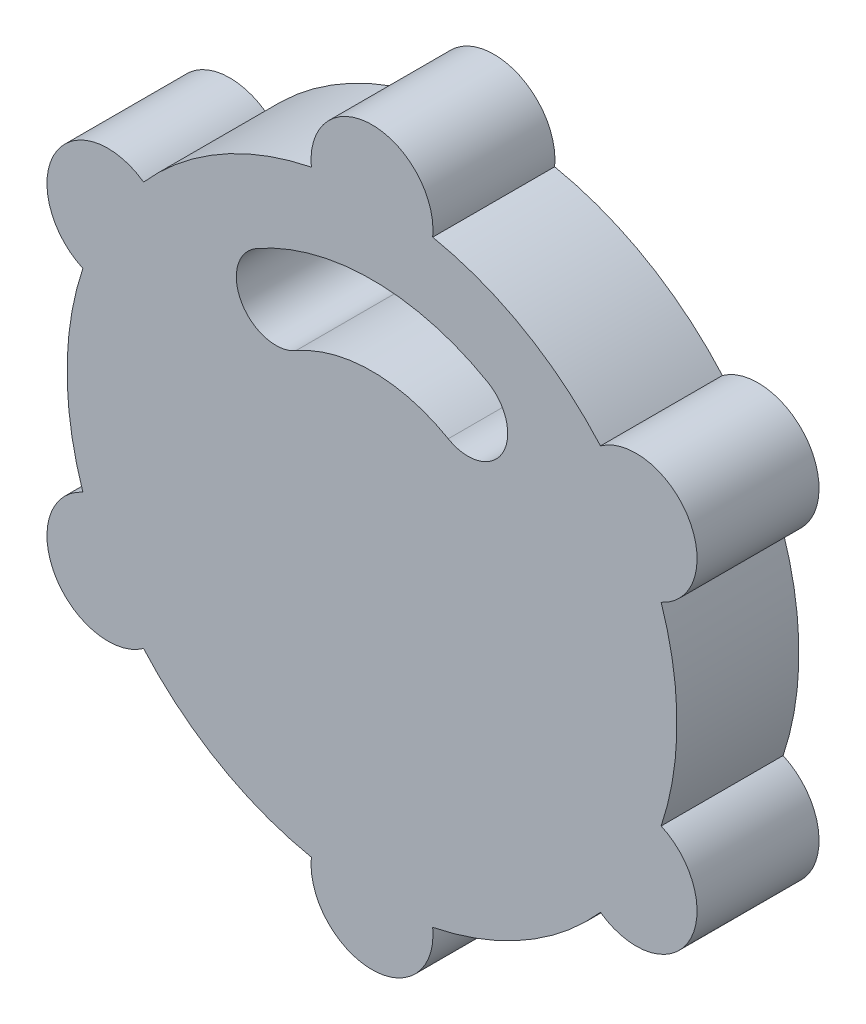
ISO-10303-21;
HEADER;
FILE_DESCRIPTION(('STEP AP214'),'2;1');
FILE_NAME('part.step','',(''),(''),'','','');
FILE_SCHEMA(('AUTOMOTIVE_DESIGN { 1 0 10303 214 1 1 1 1 }'));
ENDSEC;
DATA;
#1=APPLICATION_CONTEXT('core data for automotive mechanical design processes');
#2=APPLICATION_PROTOCOL_DEFINITION('international standard','automotive_design',2000,#1);
#3=PRODUCT_CONTEXT('',#1,'mechanical');
#4=PRODUCT('Part','Part','',(#3));
#5=PRODUCT_RELATED_PRODUCT_CATEGORY('part','',(#4));
#6=PRODUCT_DEFINITION_FORMATION('','',#4);
#7=PRODUCT_DEFINITION_CONTEXT('part definition',#1,'design');
#8=PRODUCT_DEFINITION('design','',#6,#7);
#9=PRODUCT_DEFINITION_SHAPE('','',#8);
#10=(LENGTH_UNIT() NAMED_UNIT(*) SI_UNIT(.MILLI.,.METRE.));
#11=(NAMED_UNIT(*) PLANE_ANGLE_UNIT() SI_UNIT($,.RADIAN.));
#12=(NAMED_UNIT(*) SI_UNIT($,.STERADIAN.) SOLID_ANGLE_UNIT());
#13=UNCERTAINTY_MEASURE_WITH_UNIT(LENGTH_MEASURE(1.E-05),#10,'distance_accuracy_value','');
#14=(GEOMETRIC_REPRESENTATION_CONTEXT(3) GLOBAL_UNCERTAINTY_ASSIGNED_CONTEXT((#13)) GLOBAL_UNIT_ASSIGNED_CONTEXT((#10,
#11,#12)) REPRESENTATION_CONTEXT('',''));
#15=CARTESIAN_POINT('',(0.,0.,0.));
#16=DIRECTION('',(0.,0.,1.));
#17=DIRECTION('',(1.,0.,0.));
#18=AXIS2_PLACEMENT_3D('',#15,#16,#17);
#19=CARTESIAN_POINT('',(43.301270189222,24.9999999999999,20.));
#20=DIRECTION('',(0.,0.,-1.));
#21=DIRECTION('',(-1.,0.,0.));
#22=AXIS2_PLACEMENT_3D('',#19,#20,#21);
#23=CYLINDRICAL_SURFACE('',#22,10.);
#24=CARTESIAN_POINT('',(43.301270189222,24.9999999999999,0.));
#25=DIRECTION('',(0.,0.,1.));
#26=DIRECTION('',(1.,0.,0.));
#27=AXIS2_PLACEMENT_3D('',#24,#25,#26);
#28=CIRCLE('',#27,10.);
#29=CARTESIAN_POINT('',(47.4101819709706,15.8831560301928,0.));
#30=VERTEX_POINT('',#29);
#31=CARTESIAN_POINT('',(37.4603075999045,33.1168439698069,0.));
#32=VERTEX_POINT('',#31);
#33=EDGE_CURVE('E178',#30,#32,#28,.T.);
#34=ORIENTED_EDGE('',*,*,#33,.T.);
#35=DIRECTION('',(0.,0.,-1.));
#36=VECTOR('',#35,1.);
#37=CARTESIAN_POINT('',(37.4603075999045,33.1168439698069,20.));
#38=LINE('',#37,#36);
#39=CARTESIAN_POINT('',(37.4603075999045,33.1168439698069,20.));
#40=VERTEX_POINT('',#39);
#41=EDGE_CURVE('E11',#40,#32,#38,.T.);
#42=ORIENTED_EDGE('',*,*,#41,.F.);
#43=CARTESIAN_POINT('',(43.301270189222,24.9999999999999,20.));
#44=DIRECTION('',(0.,0.,1.));
#45=DIRECTION('',(1.,0.,0.));
#46=AXIS2_PLACEMENT_3D('',#43,#44,#45);
#47=CIRCLE('',#46,10.);
#48=CARTESIAN_POINT('',(47.4101819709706,15.8831560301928,20.));
#49=VERTEX_POINT('',#48);
#50=EDGE_CURVE('E205',#49,#40,#47,.T.);
#51=ORIENTED_EDGE('',*,*,#50,.F.);
#52=DIRECTION('',(0.,0.,-1.));
#53=VECTOR('',#52,1.);
#54=CARTESIAN_POINT('',(47.4101819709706,15.8831560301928,20.));
#55=LINE('',#54,#53);
#56=EDGE_CURVE('E230',#49,#30,#55,.T.);
#57=ORIENTED_EDGE('',*,*,#56,.T.);
#58=EDGE_LOOP('',(#34,#42,#51,#57));
#59=FACE_BOUND('',#58,.T.);
#60=ADVANCED_FACE('F32',(#59),#23,.T.);
#61=CARTESIAN_POINT('',(0.,0.,20.));
#62=DIRECTION('',(0.,0.,-1.));
#63=DIRECTION('',(-1.,0.,0.));
#64=AXIS2_PLACEMENT_3D('',#61,#62,#63);
#65=CYLINDRICAL_SURFACE('',#64,50.);
#66=CARTESIAN_POINT('',(0.,0.,0.));
#67=DIRECTION('',(0.,0.,1.));
#68=DIRECTION('',(1.,0.,0.));
#69=AXIS2_PLACEMENT_3D('',#66,#67,#68);
#70=CIRCLE('',#69,50.);
#71=CARTESIAN_POINT('',(9.94987437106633,49.,0.));
#72=VERTEX_POINT('',#71);
#73=EDGE_CURVE('E183',#32,#72,#70,.T.);
#74=ORIENTED_EDGE('',*,*,#73,.T.);
#75=DIRECTION('',(0.,0.,-1.));
#76=VECTOR('',#75,1.);
#77=CARTESIAN_POINT('',(9.94987437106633,49.,20.));
#78=LINE('',#77,#76);
#79=CARTESIAN_POINT('',(9.94987437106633,49.,20.));
#80=VERTEX_POINT('',#79);
#81=EDGE_CURVE('E39',#80,#72,#78,.T.);
#82=ORIENTED_EDGE('',*,*,#81,.F.);
#83=CARTESIAN_POINT('',(0.,0.,20.));
#84=DIRECTION('',(0.,0.,1.));
#85=DIRECTION('',(1.,0.,0.));
#86=AXIS2_PLACEMENT_3D('',#83,#84,#85);
#87=CIRCLE('',#86,50.);
#88=EDGE_CURVE('E208',#40,#80,#87,.T.);
#89=ORIENTED_EDGE('',*,*,#88,.F.);
#90=ORIENTED_EDGE('',*,*,#41,.T.);
#91=EDGE_LOOP('',(#74,#82,#89,#90));
#92=FACE_BOUND('',#91,.T.);
#93=ADVANCED_FACE('F285',(#92),#65,.T.);
#94=CARTESIAN_POINT('',(1.11022302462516E-13,50.,20.));
#95=DIRECTION('',(0.,0.,-1.));
#96=DIRECTION('',(-1.,0.,0.));
#97=AXIS2_PLACEMENT_3D('',#94,#95,#96);
#98=CYLINDRICAL_SURFACE('',#97,10.);
#99=CARTESIAN_POINT('',(1.11022302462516E-13,50.,0.));
#100=DIRECTION('',(0.,0.,1.));
#101=DIRECTION('',(1.,0.,0.));
#102=AXIS2_PLACEMENT_3D('',#99,#100,#101);
#103=CIRCLE('',#102,10.);
#104=CARTESIAN_POINT('',(-9.9498743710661,49.,0.));
#105=VERTEX_POINT('',#104);
#106=EDGE_CURVE('E185',#72,#105,#103,.T.);
#107=ORIENTED_EDGE('',*,*,#106,.T.);
#108=DIRECTION('',(0.,0.,-1.));
#109=VECTOR('',#108,1.);
#110=CARTESIAN_POINT('',(-9.9498743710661,49.,20.));
#111=LINE('',#110,#109);
#112=CARTESIAN_POINT('',(-9.9498743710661,49.,20.));
#113=VERTEX_POINT('',#112);
#114=EDGE_CURVE('E257',#113,#105,#111,.T.);
#115=ORIENTED_EDGE('',*,*,#114,.F.);
#116=CARTESIAN_POINT('',(1.11022302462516E-13,50.,20.));
#117=DIRECTION('',(0.,0.,1.));
#118=DIRECTION('',(1.,0.,0.));
#119=AXIS2_PLACEMENT_3D('',#116,#117,#118);
#120=CIRCLE('',#119,10.);
#121=EDGE_CURVE('E210',#80,#113,#120,.T.);
#122=ORIENTED_EDGE('',*,*,#121,.F.);
#123=ORIENTED_EDGE('',*,*,#81,.T.);
#124=EDGE_LOOP('',(#107,#115,#122,#123));
#125=FACE_BOUND('',#124,.T.);
#126=ADVANCED_FACE('F264',(#125),#98,.T.);
#127=CARTESIAN_POINT('',(0.,0.,20.));
#128=DIRECTION('',(0.,0.,-1.));
#129=DIRECTION('',(-1.,0.,0.));
#130=AXIS2_PLACEMENT_3D('',#127,#128,#129);
#131=CYLINDRICAL_SURFACE('',#130,50.);
#132=CARTESIAN_POINT('',(0.,0.,0.));
#133=DIRECTION('',(0.,0.,1.));
#134=DIRECTION('',(1.,0.,0.));
#135=AXIS2_PLACEMENT_3D('',#132,#133,#134);
#136=CIRCLE('',#135,50.);
#137=CARTESIAN_POINT('',(-37.4603075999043,33.1168439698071,0.));
#138=VERTEX_POINT('',#137);
#139=EDGE_CURVE('E187',#105,#138,#136,.T.);
#140=ORIENTED_EDGE('',*,*,#139,.T.);
#141=DIRECTION('',(0.,0.,-1.));
#142=VECTOR('',#141,1.);
#143=CARTESIAN_POINT('',(-37.4603075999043,33.1168439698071,20.));
#144=LINE('',#143,#142);
#145=CARTESIAN_POINT('',(-37.4603075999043,33.1168439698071,20.));
#146=VERTEX_POINT('',#145);
#147=EDGE_CURVE('E254',#146,#138,#144,.T.);
#148=ORIENTED_EDGE('',*,*,#147,.F.);
#149=CARTESIAN_POINT('',(0.,0.,20.));
#150=DIRECTION('',(0.,0.,1.));
#151=DIRECTION('',(1.,0.,0.));
#152=AXIS2_PLACEMENT_3D('',#149,#150,#151);
#153=CIRCLE('',#152,50.);
#154=EDGE_CURVE('E212',#113,#146,#153,.T.);
#155=ORIENTED_EDGE('',*,*,#154,.F.);
#156=ORIENTED_EDGE('',*,*,#114,.T.);
#157=EDGE_LOOP('',(#140,#148,#155,#156));
#158=FACE_BOUND('',#157,.T.);
#159=ADVANCED_FACE('F275',(#158),#131,.T.);
#160=CARTESIAN_POINT('',(-43.3012701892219,25.0000000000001,20.));
#161=DIRECTION('',(0.,0.,-1.));
#162=DIRECTION('',(-1.,0.,0.));
#163=AXIS2_PLACEMENT_3D('',#160,#161,#162);
#164=CYLINDRICAL_SURFACE('',#163,10.);
#165=CARTESIAN_POINT('',(-43.3012701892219,25.0000000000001,0.));
#166=DIRECTION('',(0.,0.,1.));
#167=DIRECTION('',(1.,0.,0.));
#168=AXIS2_PLACEMENT_3D('',#165,#166,#167);
#169=CIRCLE('',#168,10.);
#170=CARTESIAN_POINT('',(-47.4101819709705,15.883156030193,0.));
#171=VERTEX_POINT('',#170);
#172=EDGE_CURVE('E189',#138,#171,#169,.T.);
#173=ORIENTED_EDGE('',*,*,#172,.T.);
#174=DIRECTION('',(0.,0.,-1.));
#175=VECTOR('',#174,1.);
#176=CARTESIAN_POINT('',(-47.4101819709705,15.883156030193,20.));
#177=LINE('',#176,#175);
#178=CARTESIAN_POINT('',(-47.4101819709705,15.883156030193,20.));
#179=VERTEX_POINT('',#178);
#180=EDGE_CURVE('E251',#179,#171,#177,.T.);
#181=ORIENTED_EDGE('',*,*,#180,.F.);
#182=CARTESIAN_POINT('',(-43.3012701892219,25.0000000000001,20.));
#183=DIRECTION('',(0.,0.,1.));
#184=DIRECTION('',(1.,0.,0.));
#185=AXIS2_PLACEMENT_3D('',#182,#183,#184);
#186=CIRCLE('',#185,10.);
#187=EDGE_CURVE('E214',#146,#179,#186,.T.);
#188=ORIENTED_EDGE('',*,*,#187,.F.);
#189=ORIENTED_EDGE('',*,*,#147,.T.);
#190=EDGE_LOOP('',(#173,#181,#188,#189));
#191=FACE_BOUND('',#190,.T.);
#192=ADVANCED_FACE('F279',(#191),#164,.T.);
#193=CARTESIAN_POINT('',(0.,0.,20.));
#194=DIRECTION('',(0.,0.,-1.));
#195=DIRECTION('',(-1.,0.,0.));
#196=AXIS2_PLACEMENT_3D('',#193,#194,#195);
#197=CYLINDRICAL_SURFACE('',#196,50.);
#198=CARTESIAN_POINT('',(0.,0.,0.));
#199=DIRECTION('',(0.,0.,1.));
#200=DIRECTION('',(1.,0.,0.));
#201=AXIS2_PLACEMENT_3D('',#198,#199,#200);
#202=CIRCLE('',#201,50.);
#203=CARTESIAN_POINT('',(-47.4101819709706,-15.8831560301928,0.));
#204=VERTEX_POINT('',#203);
#205=EDGE_CURVE('E191',#171,#204,#202,.T.);
#206=ORIENTED_EDGE('',*,*,#205,.T.);
#207=DIRECTION('',(0.,0.,-1.));
#208=VECTOR('',#207,1.);
#209=CARTESIAN_POINT('',(-47.4101819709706,-15.8831560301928,20.));
#210=LINE('',#209,#208);
#211=CARTESIAN_POINT('',(-47.4101819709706,-15.8831560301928,20.));
#212=VERTEX_POINT('',#211);
#213=EDGE_CURVE('E248',#212,#204,#210,.T.);
#214=ORIENTED_EDGE('',*,*,#213,.F.);
#215=CARTESIAN_POINT('',(0.,0.,20.));
#216=DIRECTION('',(0.,0.,1.));
#217=DIRECTION('',(1.,0.,0.));
#218=AXIS2_PLACEMENT_3D('',#215,#216,#217);
#219=CIRCLE('',#218,50.);
#220=EDGE_CURVE('E216',#179,#212,#219,.T.);
#221=ORIENTED_EDGE('',*,*,#220,.F.);
#222=ORIENTED_EDGE('',*,*,#180,.T.);
#223=EDGE_LOOP('',(#206,#214,#221,#222));
#224=FACE_BOUND('',#223,.T.);
#225=ADVANCED_FACE('F318',(#224),#197,.T.);
#226=CARTESIAN_POINT('',(-43.301270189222,-24.9999999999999,20.));
#227=DIRECTION('',(0.,0.,-1.));
#228=DIRECTION('',(-1.,0.,0.));
#229=AXIS2_PLACEMENT_3D('',#226,#227,#228);
#230=CYLINDRICAL_SURFACE('',#229,10.);
#231=CARTESIAN_POINT('',(-43.301270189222,-24.9999999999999,0.));
#232=DIRECTION('',(0.,0.,1.));
#233=DIRECTION('',(1.,0.,0.));
#234=AXIS2_PLACEMENT_3D('',#231,#232,#233);
#235=CIRCLE('',#234,10.);
#236=CARTESIAN_POINT('',(-37.4603075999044,-33.116843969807,0.));
#237=VERTEX_POINT('',#236);
#238=EDGE_CURVE('E193',#204,#237,#235,.T.);
#239=ORIENTED_EDGE('',*,*,#238,.T.);
#240=DIRECTION('',(0.,0.,-1.));
#241=VECTOR('',#240,1.);
#242=CARTESIAN_POINT('',(-37.4603075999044,-33.116843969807,20.));
#243=LINE('',#242,#241);
#244=CARTESIAN_POINT('',(-37.4603075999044,-33.116843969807,20.));
#245=VERTEX_POINT('',#244);
#246=EDGE_CURVE('E245',#245,#237,#243,.T.);
#247=ORIENTED_EDGE('',*,*,#246,.F.);
#248=CARTESIAN_POINT('',(-43.301270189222,-24.9999999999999,20.));
#249=DIRECTION('',(0.,0.,1.));
#250=DIRECTION('',(1.,0.,0.));
#251=AXIS2_PLACEMENT_3D('',#248,#249,#250);
#252=CIRCLE('',#251,10.);
#253=EDGE_CURVE('E218',#212,#245,#252,.T.);
#254=ORIENTED_EDGE('',*,*,#253,.F.);
#255=ORIENTED_EDGE('',*,*,#213,.T.);
#256=EDGE_LOOP('',(#239,#247,#254,#255));
#257=FACE_BOUND('',#256,.T.);
#258=ADVANCED_FACE('F316',(#257),#230,.T.);
#259=CARTESIAN_POINT('',(0.,0.,20.));
#260=DIRECTION('',(0.,0.,-1.));
#261=DIRECTION('',(-1.,0.,0.));
#262=AXIS2_PLACEMENT_3D('',#259,#260,#261);
#263=CYLINDRICAL_SURFACE('',#262,50.);
#264=CARTESIAN_POINT('',(0.,0.,0.));
#265=DIRECTION('',(0.,0.,1.));
#266=DIRECTION('',(1.,0.,0.));
#267=AXIS2_PLACEMENT_3D('',#264,#265,#266);
#268=CIRCLE('',#267,50.);
#269=CARTESIAN_POINT('',(-9.94987437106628,-48.9999999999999,0.));
#270=VERTEX_POINT('',#269);
#271=EDGE_CURVE('E195',#237,#270,#268,.T.);
#272=ORIENTED_EDGE('',*,*,#271,.T.);
#273=DIRECTION('',(0.,0.,-1.));
#274=VECTOR('',#273,1.);
#275=CARTESIAN_POINT('',(-9.94987437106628,-48.9999999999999,20.));
#276=LINE('',#275,#274);
#277=CARTESIAN_POINT('',(-9.94987437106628,-48.9999999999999,20.));
#278=VERTEX_POINT('',#277);
#279=EDGE_CURVE('E242',#278,#270,#276,.T.);
#280=ORIENTED_EDGE('',*,*,#279,.F.);
#281=CARTESIAN_POINT('',(0.,0.,20.));
#282=DIRECTION('',(0.,0.,1.));
#283=DIRECTION('',(1.,0.,0.));
#284=AXIS2_PLACEMENT_3D('',#281,#282,#283);
#285=CIRCLE('',#284,50.);
#286=EDGE_CURVE('E220',#245,#278,#285,.T.);
#287=ORIENTED_EDGE('',*,*,#286,.F.);
#288=ORIENTED_EDGE('',*,*,#246,.T.);
#289=EDGE_LOOP('',(#272,#280,#287,#288));
#290=FACE_BOUND('',#289,.T.);
#291=ADVANCED_FACE('F312',(#290),#263,.T.);
#292=CARTESIAN_POINT('',(-1.07552855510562E-13,-50.,20.));
#293=DIRECTION('',(0.,0.,-1.));
#294=DIRECTION('',(-1.,0.,0.));
#295=AXIS2_PLACEMENT_3D('',#292,#293,#294);
#296=CYLINDRICAL_SURFACE('',#295,10.);
#297=CARTESIAN_POINT('',(-1.07552855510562E-13,-50.,0.));
#298=DIRECTION('',(0.,0.,1.));
#299=DIRECTION('',(1.,0.,0.));
#300=AXIS2_PLACEMENT_3D('',#297,#298,#299);
#301=CIRCLE('',#300,10.);
#302=CARTESIAN_POINT('',(9.94987437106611,-49.,0.));
#303=VERTEX_POINT('',#302);
#304=EDGE_CURVE('E197',#270,#303,#301,.T.);
#305=ORIENTED_EDGE('',*,*,#304,.T.);
#306=DIRECTION('',(0.,0.,-1.));
#307=VECTOR('',#306,1.);
#308=CARTESIAN_POINT('',(9.94987437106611,-49.,20.));
#309=LINE('',#308,#307);
#310=CARTESIAN_POINT('',(9.94987437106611,-49.,20.));
#311=VERTEX_POINT('',#310);
#312=EDGE_CURVE('E239',#311,#303,#309,.T.);
#313=ORIENTED_EDGE('',*,*,#312,.F.);
#314=CARTESIAN_POINT('',(-1.07552855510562E-13,-50.,20.));
#315=DIRECTION('',(0.,0.,1.));
#316=DIRECTION('',(1.,0.,0.));
#317=AXIS2_PLACEMENT_3D('',#314,#315,#316);
#318=CIRCLE('',#317,10.);
#319=EDGE_CURVE('E222',#278,#311,#318,.T.);
#320=ORIENTED_EDGE('',*,*,#319,.F.);
#321=ORIENTED_EDGE('',*,*,#279,.T.);
#322=EDGE_LOOP('',(#305,#313,#320,#321));
#323=FACE_BOUND('',#322,.T.);
#324=ADVANCED_FACE('F307',(#323),#296,.T.);
#325=CARTESIAN_POINT('',(0.,0.,20.));
#326=DIRECTION('',(0.,0.,-1.));
#327=DIRECTION('',(-1.,0.,0.));
#328=AXIS2_PLACEMENT_3D('',#325,#326,#327);
#329=CYLINDRICAL_SURFACE('',#328,50.);
#330=CARTESIAN_POINT('',(0.,0.,0.));
#331=DIRECTION('',(0.,0.,1.));
#332=DIRECTION('',(1.,0.,0.));
#333=AXIS2_PLACEMENT_3D('',#330,#331,#332);
#334=CIRCLE('',#333,50.);
#335=CARTESIAN_POINT('',(37.4603075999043,-33.1168439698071,0.));
#336=VERTEX_POINT('',#335);
#337=EDGE_CURVE('E199',#303,#336,#334,.T.);
#338=ORIENTED_EDGE('',*,*,#337,.T.);
#339=DIRECTION('',(0.,0.,-1.));
#340=VECTOR('',#339,1.);
#341=CARTESIAN_POINT('',(37.4603075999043,-33.1168439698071,20.));
#342=LINE('',#341,#340);
#343=CARTESIAN_POINT('',(37.4603075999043,-33.1168439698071,20.));
#344=VERTEX_POINT('',#343);
#345=EDGE_CURVE('E236',#344,#336,#342,.T.);
#346=ORIENTED_EDGE('',*,*,#345,.F.);
#347=CARTESIAN_POINT('',(0.,0.,20.));
#348=DIRECTION('',(0.,0.,1.));
#349=DIRECTION('',(1.,0.,0.));
#350=AXIS2_PLACEMENT_3D('',#347,#348,#349);
#351=CIRCLE('',#350,50.);
#352=EDGE_CURVE('E224',#311,#344,#351,.T.);
#353=ORIENTED_EDGE('',*,*,#352,.F.);
#354=ORIENTED_EDGE('',*,*,#312,.T.);
#355=EDGE_LOOP('',(#338,#346,#353,#354));
#356=FACE_BOUND('',#355,.T.);
#357=ADVANCED_FACE('F301',(#356),#329,.T.);
#358=CARTESIAN_POINT('',(43.3012701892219,-25.0000000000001,20.));
#359=DIRECTION('',(0.,0.,-1.));
#360=DIRECTION('',(-1.,0.,0.));
#361=AXIS2_PLACEMENT_3D('',#358,#359,#360);
#362=CYLINDRICAL_SURFACE('',#361,10.);
#363=CARTESIAN_POINT('',(43.3012701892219,-25.0000000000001,0.));
#364=DIRECTION('',(0.,0.,1.));
#365=DIRECTION('',(1.,0.,0.));
#366=AXIS2_PLACEMENT_3D('',#363,#364,#365);
#367=CIRCLE('',#366,10.);
#368=CARTESIAN_POINT('',(47.4101819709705,-15.883156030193,0.));
#369=VERTEX_POINT('',#368);
#370=EDGE_CURVE('E201',#336,#369,#367,.T.);
#371=ORIENTED_EDGE('',*,*,#370,.T.);
#372=DIRECTION('',(0.,0.,-1.));
#373=VECTOR('',#372,1.);
#374=CARTESIAN_POINT('',(47.4101819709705,-15.883156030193,20.));
#375=LINE('',#374,#373);
#376=CARTESIAN_POINT('',(47.4101819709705,-15.883156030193,20.));
#377=VERTEX_POINT('',#376);
#378=EDGE_CURVE('E233',#377,#369,#375,.T.);
#379=ORIENTED_EDGE('',*,*,#378,.F.);
#380=CARTESIAN_POINT('',(43.3012701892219,-25.0000000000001,20.));
#381=DIRECTION('',(0.,0.,1.));
#382=DIRECTION('',(1.,0.,0.));
#383=AXIS2_PLACEMENT_3D('',#380,#381,#382);
#384=CIRCLE('',#383,10.);
#385=EDGE_CURVE('E226',#344,#377,#384,.T.);
#386=ORIENTED_EDGE('',*,*,#385,.F.);
#387=ORIENTED_EDGE('',*,*,#345,.T.);
#388=EDGE_LOOP('',(#371,#379,#386,#387));
#389=FACE_BOUND('',#388,.T.);
#390=ADVANCED_FACE('F297',(#389),#362,.T.);
#391=CARTESIAN_POINT('',(0.,0.,20.));
#392=DIRECTION('',(0.,0.,-1.));
#393=DIRECTION('',(-1.,0.,0.));
#394=AXIS2_PLACEMENT_3D('',#391,#392,#393);
#395=CYLINDRICAL_SURFACE('',#394,50.);
#396=CARTESIAN_POINT('',(0.,0.,0.));
#397=DIRECTION('',(0.,0.,1.));
#398=DIRECTION('',(1.,0.,0.));
#399=AXIS2_PLACEMENT_3D('',#396,#397,#398);
#400=CIRCLE('',#399,50.);
#401=EDGE_CURVE('E203',#369,#30,#400,.T.);
#402=ORIENTED_EDGE('',*,*,#401,.T.);
#403=ORIENTED_EDGE('',*,*,#56,.F.);
#404=CARTESIAN_POINT('',(0.,0.,20.));
#405=DIRECTION('',(0.,0.,1.));
#406=DIRECTION('',(1.,0.,0.));
#407=AXIS2_PLACEMENT_3D('',#404,#405,#406);
#408=CIRCLE('',#407,50.);
#409=EDGE_CURVE('E228',#377,#49,#408,.T.);
#410=ORIENTED_EDGE('',*,*,#409,.F.);
#411=ORIENTED_EDGE('',*,*,#378,.T.);
#412=EDGE_LOOP('',(#402,#403,#410,#411));
#413=FACE_BOUND('',#412,.T.);
#414=ADVANCED_FACE('F292',(#413),#395,.T.);
#415=CARTESIAN_POINT('',(21.650635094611,12.4999999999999,20.));
#416=DIRECTION('',(0.,0.,1.));
#417=DIRECTION('',(1.,0.,0.));
#418=AXIS2_PLACEMENT_3D('',#415,#416,#417);
#419=PLANE('',#418);
#420=CARTESIAN_POINT('',(0.,0.,20.));
#421=DIRECTION('',(0.,0.,1.));
#422=DIRECTION('',(1.,0.,0.));
#423=AXIS2_PLACEMENT_3D('',#420,#421,#422);
#424=CIRCLE('',#423,38.);
#425=CARTESIAN_POINT('',(19.,32.9089653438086,20.));
#426=VERTEX_POINT('',#425);
#427=CARTESIAN_POINT('',(-19.,32.9089653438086,20.));
#428=VERTEX_POINT('',#427);
#429=EDGE_CURVE('E46',#426,#428,#424,.T.);
#430=ORIENTED_EDGE('',*,*,#429,.F.);
#431=CARTESIAN_POINT('',(15.75,27.2798002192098,20.));
#432=DIRECTION('',(0.,0.,1.));
#433=DIRECTION('',(1.,0.,0.));
#434=AXIS2_PLACEMENT_3D('',#431,#432,#433);
#435=CIRCLE('',#434,6.5);
#436=CARTESIAN_POINT('',(12.5,21.650635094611,20.));
#437=VERTEX_POINT('',#436);
#438=EDGE_CURVE('E162',#437,#426,#435,.T.);
#439=ORIENTED_EDGE('',*,*,#438,.F.);
#440=CARTESIAN_POINT('',(0.,0.,20.));
#441=DIRECTION('',(0.,0.,-1.));
#442=DIRECTION('',(1.,0.,0.));
#443=AXIS2_PLACEMENT_3D('',#440,#441,#442);
#444=CIRCLE('',#443,25.);
#445=CARTESIAN_POINT('',(-12.5,21.650635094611,20.));
#446=VERTEX_POINT('',#445);
#447=EDGE_CURVE('E146',#446,#437,#444,.T.);
#448=ORIENTED_EDGE('',*,*,#447,.F.);
#449=CARTESIAN_POINT('',(-15.75,27.2798002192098,20.));
#450=DIRECTION('',(0.,0.,1.));
#451=DIRECTION('',(1.,0.,0.));
#452=AXIS2_PLACEMENT_3D('',#449,#450,#451);
#453=CIRCLE('',#452,6.5);
#454=EDGE_CURVE('E155',#428,#446,#453,.T.);
#455=ORIENTED_EDGE('',*,*,#454,.F.);
#456=EDGE_LOOP('',(#430,#439,#448,#455));
#457=FACE_BOUND('',#456,.T.);
#458=ORIENTED_EDGE('',*,*,#50,.T.);
#459=ORIENTED_EDGE('',*,*,#88,.T.);
#460=ORIENTED_EDGE('',*,*,#121,.T.);
#461=ORIENTED_EDGE('',*,*,#154,.T.);
#462=ORIENTED_EDGE('',*,*,#187,.T.);
#463=ORIENTED_EDGE('',*,*,#220,.T.);
#464=ORIENTED_EDGE('',*,*,#253,.T.);
#465=ORIENTED_EDGE('',*,*,#286,.T.);
#466=ORIENTED_EDGE('',*,*,#319,.T.);
#467=ORIENTED_EDGE('',*,*,#352,.T.);
#468=ORIENTED_EDGE('',*,*,#385,.T.);
#469=ORIENTED_EDGE('',*,*,#409,.T.);
#470=EDGE_LOOP('',(#458,#459,#460,#461,#462,#463,#464,#465,#466,#467,#468,#469));
#471=FACE_BOUND('',#470,.T.);
#472=ADVANCED_FACE('F159',(#457,#471),#419,.T.);
#473=CARTESIAN_POINT('',(21.650635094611,12.4999999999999,0.));
#474=DIRECTION('',(0.,0.,1.));
#475=DIRECTION('',(1.,0.,0.));
#476=AXIS2_PLACEMENT_3D('',#473,#474,#475);
#477=PLANE('',#476);
#478=CARTESIAN_POINT('',(15.75,27.2798002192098,0.));
#479=DIRECTION('',(0.,0.,1.));
#480=DIRECTION('',(1.,0.,0.));
#481=AXIS2_PLACEMENT_3D('',#478,#479,#480);
#482=CIRCLE('',#481,6.5);
#483=CARTESIAN_POINT('',(12.5,21.650635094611,0.));
#484=VERTEX_POINT('',#483);
#485=CARTESIAN_POINT('',(19.,32.9089653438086,0.));
#486=VERTEX_POINT('',#485);
#487=EDGE_CURVE('E173',#484,#486,#482,.T.);
#488=ORIENTED_EDGE('',*,*,#487,.T.);
#489=CARTESIAN_POINT('',(0.,0.,0.));
#490=DIRECTION('',(0.,0.,1.));
#491=DIRECTION('',(1.,0.,0.));
#492=AXIS2_PLACEMENT_3D('',#489,#490,#491);
#493=CIRCLE('',#492,38.);
#494=CARTESIAN_POINT('',(-19.,32.9089653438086,0.));
#495=VERTEX_POINT('',#494);
#496=EDGE_CURVE('E164',#486,#495,#493,.T.);
#497=ORIENTED_EDGE('',*,*,#496,.T.);
#498=CARTESIAN_POINT('',(-15.75,27.2798002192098,0.));
#499=DIRECTION('',(0.,0.,1.));
#500=DIRECTION('',(1.,0.,0.));
#501=AXIS2_PLACEMENT_3D('',#498,#499,#500);
#502=CIRCLE('',#501,6.5);
#503=CARTESIAN_POINT('',(-12.5,21.650635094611,0.));
#504=VERTEX_POINT('',#503);
#505=EDGE_CURVE('E170',#495,#504,#502,.T.);
#506=ORIENTED_EDGE('',*,*,#505,.T.);
#507=CARTESIAN_POINT('',(0.,0.,0.));
#508=DIRECTION('',(0.,0.,-1.));
#509=DIRECTION('',(1.,0.,0.));
#510=AXIS2_PLACEMENT_3D('',#507,#508,#509);
#511=CIRCLE('',#510,25.);
#512=EDGE_CURVE('E54',#504,#484,#511,.T.);
#513=ORIENTED_EDGE('',*,*,#512,.T.);
#514=EDGE_LOOP('',(#488,#497,#506,#513));
#515=FACE_BOUND('',#514,.T.);
#516=ORIENTED_EDGE('',*,*,#33,.F.);
#517=ORIENTED_EDGE('',*,*,#401,.F.);
#518=ORIENTED_EDGE('',*,*,#370,.F.);
#519=ORIENTED_EDGE('',*,*,#337,.F.);
#520=ORIENTED_EDGE('',*,*,#304,.F.);
#521=ORIENTED_EDGE('',*,*,#271,.F.);
#522=ORIENTED_EDGE('',*,*,#238,.F.);
#523=ORIENTED_EDGE('',*,*,#205,.F.);
#524=ORIENTED_EDGE('',*,*,#172,.F.);
#525=ORIENTED_EDGE('',*,*,#139,.F.);
#526=ORIENTED_EDGE('',*,*,#106,.F.);
#527=ORIENTED_EDGE('',*,*,#73,.F.);
#528=EDGE_LOOP('',(#516,#517,#518,#519,#520,#521,#522,#523,#524,#525,#526,#527));
#529=FACE_BOUND('',#528,.T.);
#530=ADVANCED_FACE('F270',(#515,#529),#477,.F.);
#531=CARTESIAN_POINT('',(0.,0.,0.));
#532=DIRECTION('',(0.,0.,1.));
#533=DIRECTION('',(1.,0.,0.));
#534=AXIS2_PLACEMENT_3D('',#531,#532,#533);
#535=CYLINDRICAL_SURFACE('',#534,38.);
#536=ORIENTED_EDGE('',*,*,#429,.T.);
#537=DIRECTION('',(0.,0.,1.));
#538=VECTOR('',#537,1.);
#539=CARTESIAN_POINT('',(-19.,32.9089653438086,0.));
#540=LINE('',#539,#538);
#541=EDGE_CURVE('E152',#495,#428,#540,.T.);
#542=ORIENTED_EDGE('',*,*,#541,.F.);
#543=ORIENTED_EDGE('',*,*,#496,.F.);
#544=DIRECTION('',(0.,0.,1.));
#545=VECTOR('',#544,1.);
#546=CARTESIAN_POINT('',(19.,32.9089653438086,0.));
#547=LINE('',#546,#545);
#548=EDGE_CURVE('E176',#486,#426,#547,.T.);
#549=ORIENTED_EDGE('',*,*,#548,.T.);
#550=EDGE_LOOP('',(#536,#542,#543,#549));
#551=FACE_BOUND('',#550,.T.);
#552=ADVANCED_FACE('F412',(#551),#535,.F.);
#553=CARTESIAN_POINT('',(15.75,27.2798002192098,0.));
#554=DIRECTION('',(0.,0.,1.));
#555=DIRECTION('',(1.,0.,0.));
#556=AXIS2_PLACEMENT_3D('',#553,#554,#555);
#557=CYLINDRICAL_SURFACE('',#556,6.5);
#558=ORIENTED_EDGE('',*,*,#438,.T.);
#559=ORIENTED_EDGE('',*,*,#548,.F.);
#560=ORIENTED_EDGE('',*,*,#487,.F.);
#561=DIRECTION('',(0.,0.,1.));
#562=VECTOR('',#561,1.);
#563=CARTESIAN_POINT('',(12.5,21.650635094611,0.));
#564=LINE('',#563,#562);
#565=EDGE_CURVE('E151',#484,#437,#564,.T.);
#566=ORIENTED_EDGE('',*,*,#565,.T.);
#567=EDGE_LOOP('',(#558,#559,#560,#566));
#568=FACE_BOUND('',#567,.T.);
#569=ADVANCED_FACE('F422',(#568),#557,.F.);
#570=CARTESIAN_POINT('',(0.,0.,0.));
#571=DIRECTION('',(0.,0.,1.));
#572=DIRECTION('',(1.,0.,0.));
#573=AXIS2_PLACEMENT_3D('',#570,#571,#572);
#574=CYLINDRICAL_SURFACE('',#573,25.);
#575=ORIENTED_EDGE('',*,*,#447,.T.);
#576=ORIENTED_EDGE('',*,*,#565,.F.);
#577=ORIENTED_EDGE('',*,*,#512,.F.);
#578=DIRECTION('',(0.,0.,1.));
#579=VECTOR('',#578,1.);
#580=CARTESIAN_POINT('',(-12.5,21.650635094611,0.));
#581=LINE('',#580,#579);
#582=EDGE_CURVE('E142',#504,#446,#581,.T.);
#583=ORIENTED_EDGE('',*,*,#582,.T.);
#584=EDGE_LOOP('',(#575,#576,#577,#583));
#585=FACE_BOUND('',#584,.T.);
#586=ADVANCED_FACE('F144',(#585),#574,.T.);
#587=CARTESIAN_POINT('',(-15.75,27.2798002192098,0.));
#588=DIRECTION('',(0.,0.,1.));
#589=DIRECTION('',(1.,0.,0.));
#590=AXIS2_PLACEMENT_3D('',#587,#588,#589);
#591=CYLINDRICAL_SURFACE('',#590,6.5);
#592=ORIENTED_EDGE('',*,*,#454,.T.);
#593=ORIENTED_EDGE('',*,*,#582,.F.);
#594=ORIENTED_EDGE('',*,*,#505,.F.);
#595=ORIENTED_EDGE('',*,*,#541,.T.);
#596=EDGE_LOOP('',(#592,#593,#594,#595));
#597=FACE_BOUND('',#596,.T.);
#598=ADVANCED_FACE('F156',(#597),#591,.F.);
#599=CLOSED_SHELL('',(#60,#93,#126,#159,#192,#225,#258,#291,#324,#357,#390,#414,#472,#530,#552,
#569,#586,#598));
#600=MANIFOLD_SOLID_BREP('B2',#599);
#601=ADVANCED_BREP_SHAPE_REPRESENTATION('',(#18,#600),#14);
#602=SHAPE_DEFINITION_REPRESENTATION(#9,#601);
ENDSEC;
END-ISO-10303-21;
